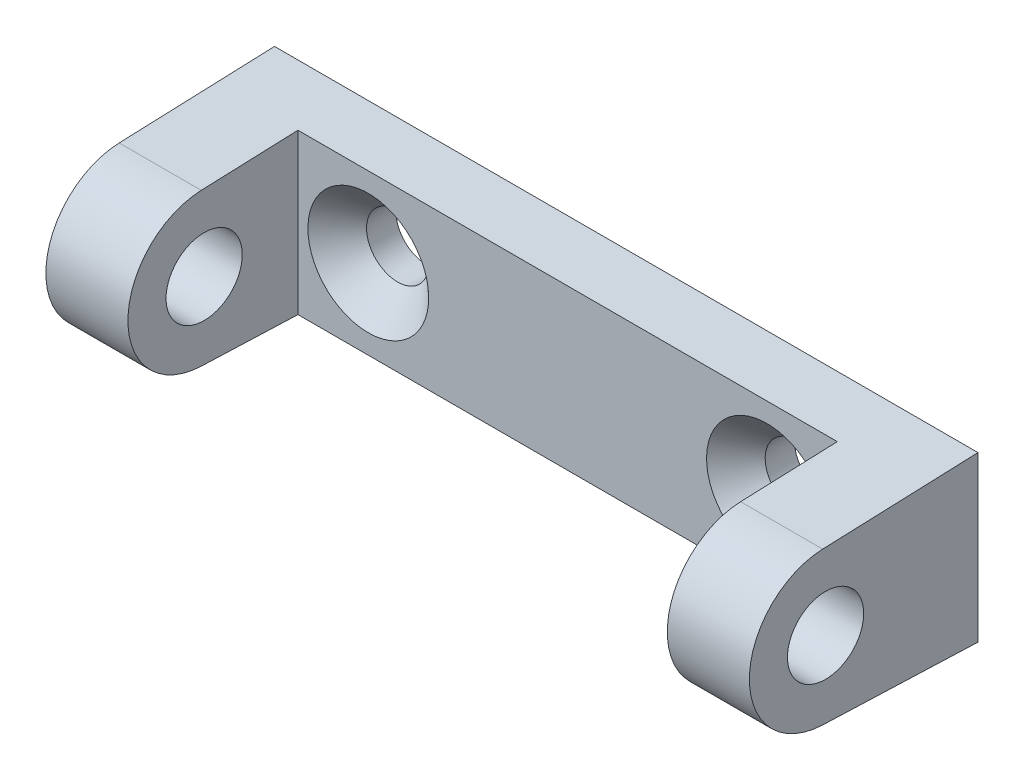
ISO-10303-21;
HEADER;
FILE_DESCRIPTION(('STEP AP214'),'2;1');
FILE_NAME('part.step','',(''),(''),'','','');
FILE_SCHEMA(('AUTOMOTIVE_DESIGN { 1 0 10303 214 1 1 1 1 }'));
ENDSEC;
DATA;
#1=APPLICATION_CONTEXT('core data for automotive mechanical design processes');
#2=APPLICATION_PROTOCOL_DEFINITION('international standard','automotive_design',2000,#1);
#3=PRODUCT_CONTEXT('',#1,'mechanical');
#4=PRODUCT('Part','Part','',(#3));
#5=PRODUCT_RELATED_PRODUCT_CATEGORY('part','',(#4));
#6=PRODUCT_DEFINITION_FORMATION('','',#4);
#7=PRODUCT_DEFINITION_CONTEXT('part definition',#1,'design');
#8=PRODUCT_DEFINITION('design','',#6,#7);
#9=PRODUCT_DEFINITION_SHAPE('','',#8);
#10=(LENGTH_UNIT() NAMED_UNIT(*) SI_UNIT(.MILLI.,.METRE.));
#11=(NAMED_UNIT(*) PLANE_ANGLE_UNIT() SI_UNIT($,.RADIAN.));
#12=(NAMED_UNIT(*) SI_UNIT($,.STERADIAN.) SOLID_ANGLE_UNIT());
#13=UNCERTAINTY_MEASURE_WITH_UNIT(LENGTH_MEASURE(1.E-05),#10,'distance_accuracy_value','');
#14=(GEOMETRIC_REPRESENTATION_CONTEXT(3) GLOBAL_UNCERTAINTY_ASSIGNED_CONTEXT((#13)) GLOBAL_UNIT_ASSIGNED_CONTEXT((#10,
#11,#12)) REPRESENTATION_CONTEXT('',''));
#15=CARTESIAN_POINT('',(0.,0.,0.));
#16=DIRECTION('',(0.,0.,1.));
#17=DIRECTION('',(1.,0.,0.));
#18=AXIS2_PLACEMENT_3D('',#15,#16,#17);
#19=CARTESIAN_POINT('',(-13.,0.,13.));
#20=DIRECTION('',(1.,0.,0.));
#21=DIRECTION('',(0.,1.,0.));
#22=AXIS2_PLACEMENT_3D('',#19,#20,#21);
#23=PLANE('',#22);
#24=CARTESIAN_POINT('',(-13.,0.,13.));
#25=DIRECTION('',(1.,0.,0.));
#26=DIRECTION('',(0.,1.,0.));
#27=AXIS2_PLACEMENT_3D('',#24,#25,#26);
#28=CIRCLE('',#27,6.5);
#29=CARTESIAN_POINT('',(-13.,6.49528769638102,13.2474626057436));
#30=VERTEX_POINT('',#29);
#31=CARTESIAN_POINT('',(-13.,-6.49528769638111,13.2474626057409));
#32=VERTEX_POINT('',#31);
#33=EDGE_CURVE('E142',#30,#32,#28,.T.);
#34=ORIENTED_EDGE('',*,*,#33,.F.);
#35=DIRECTION('',(0.,-0.0380711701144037,0.999275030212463));
#36=VECTOR('',#35,1.);
#37=CARTESIAN_POINT('',(-13.,6.49528769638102,13.2474626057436));
#38=LINE('',#37,#36);
#39=CARTESIAN_POINT('',(-13.,7.,0.));
#40=VERTEX_POINT('',#39);
#41=EDGE_CURVE('E149',#40,#30,#38,.T.);
#42=ORIENTED_EDGE('',*,*,#41,.F.);
#43=DIRECTION('',(0.,1.,0.));
#44=VECTOR('',#43,1.);
#45=CARTESIAN_POINT('',(-13.,7.,0.));
#46=LINE('',#45,#44);
#47=CARTESIAN_POINT('',(-13.,-7.,0.));
#48=VERTEX_POINT('',#47);
#49=EDGE_CURVE('E147',#48,#40,#46,.T.);
#50=ORIENTED_EDGE('',*,*,#49,.F.);
#51=DIRECTION('',(0.,-0.0380711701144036,-0.999275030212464));
#52=VECTOR('',#51,1.);
#53=CARTESIAN_POINT('',(-13.,-7.,0.));
#54=LINE('',#53,#52);
#55=EDGE_CURVE('E145',#32,#48,#54,.T.);
#56=ORIENTED_EDGE('',*,*,#55,.F.);
#57=EDGE_LOOP('',(#34,#42,#50,#56));
#58=FACE_BOUND('',#57,.T.);
#59=CARTESIAN_POINT('',(-13.,0.,13.));
#60=DIRECTION('',(1.,0.,0.));
#61=DIRECTION('',(0.,1.,0.));
#62=AXIS2_PLACEMENT_3D('',#59,#60,#61);
#63=CIRCLE('',#62,3.25);
#64=CARTESIAN_POINT('',(-13.,3.25000000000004,13.));
#65=VERTEX_POINT('',#64);
#66=EDGE_CURVE('E120',#65,#65,#63,.T.);
#67=ORIENTED_EDGE('',*,*,#66,.T.);
#68=EDGE_LOOP('',(#67));
#69=FACE_BOUND('',#68,.T.);
#70=ADVANCED_FACE('F14',(#58,#69),#23,.F.);
#71=CARTESIAN_POINT('',(47.,0.,13.));
#72=DIRECTION('',(1.,0.,0.));
#73=DIRECTION('',(0.,1.,0.));
#74=AXIS2_PLACEMENT_3D('',#71,#72,#73);
#75=PLANE('',#74);
#76=CARTESIAN_POINT('',(47.,0.,13.));
#77=DIRECTION('',(1.,0.,0.));
#78=DIRECTION('',(0.,1.,0.));
#79=AXIS2_PLACEMENT_3D('',#76,#77,#78);
#80=CIRCLE('',#79,6.5);
#81=CARTESIAN_POINT('',(47.,6.49528769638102,13.2474626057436));
#82=VERTEX_POINT('',#81);
#83=CARTESIAN_POINT('',(47.,-6.49528769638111,13.2474626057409));
#84=VERTEX_POINT('',#83);
#85=EDGE_CURVE('E152',#82,#84,#80,.T.);
#86=ORIENTED_EDGE('',*,*,#85,.T.);
#87=DIRECTION('',(0.,-0.0380711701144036,-0.999275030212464));
#88=VECTOR('',#87,1.);
#89=CARTESIAN_POINT('',(47.,-7.,0.));
#90=LINE('',#89,#88);
#91=CARTESIAN_POINT('',(47.,-7.,0.));
#92=VERTEX_POINT('',#91);
#93=EDGE_CURVE('E80',#84,#92,#90,.T.);
#94=ORIENTED_EDGE('',*,*,#93,.T.);
#95=DIRECTION('',(0.,1.,0.));
#96=VECTOR('',#95,1.);
#97=CARTESIAN_POINT('',(47.,7.,0.));
#98=LINE('',#97,#96);
#99=CARTESIAN_POINT('',(47.,7.,0.));
#100=VERTEX_POINT('',#99);
#101=EDGE_CURVE('E155',#92,#100,#98,.T.);
#102=ORIENTED_EDGE('',*,*,#101,.T.);
#103=DIRECTION('',(0.,-0.0380711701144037,0.999275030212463));
#104=VECTOR('',#103,1.);
#105=CARTESIAN_POINT('',(47.,6.49528769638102,13.2474626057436));
#106=LINE('',#105,#104);
#107=EDGE_CURVE('E157',#100,#82,#106,.T.);
#108=ORIENTED_EDGE('',*,*,#107,.T.);
#109=EDGE_LOOP('',(#86,#94,#102,#108));
#110=FACE_BOUND('',#109,.T.);
#111=CARTESIAN_POINT('',(47.,0.,13.));
#112=DIRECTION('',(1.,0.,0.));
#113=DIRECTION('',(0.,1.,0.));
#114=AXIS2_PLACEMENT_3D('',#111,#112,#113);
#115=CIRCLE('',#114,3.25);
#116=CARTESIAN_POINT('',(47.,3.25000000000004,13.));
#117=VERTEX_POINT('',#116);
#118=EDGE_CURVE('E117',#117,#117,#115,.T.);
#119=ORIENTED_EDGE('',*,*,#118,.F.);
#120=EDGE_LOOP('',(#119));
#121=FACE_BOUND('',#120,.T.);
#122=ADVANCED_FACE('F185',(#110,#121),#75,.T.);
#123=CARTESIAN_POINT('',(47.,7.,0.));
#124=DIRECTION('',(0.,0.,1.));
#125=DIRECTION('',(0.,-1.,0.));
#126=AXIS2_PLACEMENT_3D('',#123,#124,#125);
#127=PLANE('',#126);
#128=CARTESIAN_POINT('',(34.,0.,0.));
#129=DIRECTION('',(0.,0.,1.));
#130=DIRECTION('',(0.,-1.,0.));
#131=AXIS2_PLACEMENT_3D('',#128,#129,#130);
#132=CIRCLE('',#131,2.64999999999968);
#133=CARTESIAN_POINT('',(34.,-2.64999999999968,0.));
#134=VERTEX_POINT('',#133);
#135=EDGE_CURVE('E132',#134,#134,#132,.T.);
#136=ORIENTED_EDGE('',*,*,#135,.T.);
#137=EDGE_LOOP('',(#136));
#138=FACE_BOUND('',#137,.T.);
#139=ORIENTED_EDGE('',*,*,#49,.T.);
#140=DIRECTION('',(-1.,0.,0.));
#141=VECTOR('',#140,1.);
#142=CARTESIAN_POINT('',(47.,7.,0.));
#143=LINE('',#142,#141);
#144=EDGE_CURVE('E161',#100,#40,#143,.T.);
#145=ORIENTED_EDGE('',*,*,#144,.F.);
#146=ORIENTED_EDGE('',*,*,#101,.F.);
#147=DIRECTION('',(-1.,0.,0.));
#148=VECTOR('',#147,1.);
#149=CARTESIAN_POINT('',(47.,-7.,0.));
#150=LINE('',#149,#148);
#151=EDGE_CURVE('E164',#92,#48,#150,.T.);
#152=ORIENTED_EDGE('',*,*,#151,.T.);
#153=EDGE_LOOP('',(#139,#145,#146,#152));
#154=FACE_BOUND('',#153,.T.);
#155=CARTESIAN_POINT('',(0.,0.,0.));
#156=DIRECTION('',(0.,0.,1.));
#157=DIRECTION('',(0.,-1.,0.));
#158=AXIS2_PLACEMENT_3D('',#155,#156,#157);
#159=CIRCLE('',#158,2.64999999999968);
#160=CARTESIAN_POINT('',(0.,-2.64999999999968,0.));
#161=VERTEX_POINT('',#160);
#162=EDGE_CURVE('E123',#161,#161,#159,.T.);
#163=ORIENTED_EDGE('',*,*,#162,.T.);
#164=EDGE_LOOP('',(#163));
#165=FACE_BOUND('',#164,.T.);
#166=ADVANCED_FACE('F182',(#138,#154,#165),#127,.F.);
#167=CARTESIAN_POINT('',(-6.25,29.3487880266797,4.9999999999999));
#168=DIRECTION('',(0.,0.,1.));
#169=DIRECTION('',(1.,0.,0.));
#170=AXIS2_PLACEMENT_3D('',#167,#168,#169);
#171=PLANE('',#170);
#172=DIRECTION('',(0.,-1.,0.));
#173=VECTOR('',#172,1.);
#174=CARTESIAN_POINT('',(40.,6.8095060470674,5.));
#175=LINE('',#174,#173);
#176=CARTESIAN_POINT('',(40.,6.8095060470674,5.));
#177=VERTEX_POINT('',#176);
#178=CARTESIAN_POINT('',(40.,-6.8095060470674,5.));
#179=VERTEX_POINT('',#178);
#180=EDGE_CURVE('E33',#177,#179,#175,.T.);
#181=ORIENTED_EDGE('',*,*,#180,.F.);
#182=DIRECTION('',(-1.,0.,0.));
#183=VECTOR('',#182,1.);
#184=CARTESIAN_POINT('',(47.,6.8095060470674,5.));
#185=LINE('',#184,#183);
#186=CARTESIAN_POINT('',(-6.,6.8095060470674,5.));
#187=VERTEX_POINT('',#186);
#188=EDGE_CURVE('E9',#177,#187,#185,.T.);
#189=ORIENTED_EDGE('',*,*,#188,.T.);
#190=DIRECTION('',(0.,1.,0.));
#191=VECTOR('',#190,1.);
#192=CARTESIAN_POINT('',(-6.,-6.8095060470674,5.));
#193=LINE('',#192,#191);
#194=CARTESIAN_POINT('',(-6.,-6.8095060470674,5.));
#195=VERTEX_POINT('',#194);
#196=EDGE_CURVE('E111',#195,#187,#193,.T.);
#197=ORIENTED_EDGE('',*,*,#196,.F.);
#198=DIRECTION('',(1.,0.,0.));
#199=VECTOR('',#198,1.);
#200=CARTESIAN_POINT('',(47.,-6.8095060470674,5.));
#201=LINE('',#200,#199);
#202=EDGE_CURVE('E29',#195,#179,#201,.T.);
#203=ORIENTED_EDGE('',*,*,#202,.T.);
#204=EDGE_LOOP('',(#181,#189,#197,#203));
#205=FACE_BOUND('',#204,.T.);
#206=CARTESIAN_POINT('',(34.,0.,5.));
#207=DIRECTION('',(0.,0.,1.));
#208=DIRECTION('',(0.,-1.,0.));
#209=AXIS2_PLACEMENT_3D('',#206,#207,#208);
#210=CIRCLE('',#209,5.14999999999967);
#211=CARTESIAN_POINT('',(34.,-5.14999999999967,5.));
#212=VERTEX_POINT('',#211);
#213=EDGE_CURVE('E138',#212,#212,#210,.T.);
#214=ORIENTED_EDGE('',*,*,#213,.F.);
#215=EDGE_LOOP('',(#214));
#216=FACE_BOUND('',#215,.T.);
#217=CARTESIAN_POINT('',(0.,0.,5.));
#218=DIRECTION('',(0.,0.,1.));
#219=DIRECTION('',(0.,-1.,0.));
#220=AXIS2_PLACEMENT_3D('',#217,#218,#219);
#221=CIRCLE('',#220,5.14999999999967);
#222=CARTESIAN_POINT('',(0.,-5.14999999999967,5.));
#223=VERTEX_POINT('',#222);
#224=EDGE_CURVE('E129',#223,#223,#221,.T.);
#225=ORIENTED_EDGE('',*,*,#224,.F.);
#226=EDGE_LOOP('',(#225));
#227=FACE_BOUND('',#226,.T.);
#228=ADVANCED_FACE('F187',(#205,#216,#227),#171,.T.);
#229=CARTESIAN_POINT('',(47.,0.,13.));
#230=DIRECTION('',(-1.,0.,0.));
#231=DIRECTION('',(0.,-1.,0.));
#232=AXIS2_PLACEMENT_3D('',#229,#230,#231);
#233=CYLINDRICAL_SURFACE('',#232,6.5);
#234=DIRECTION('',(-1.,0.,0.));
#235=VECTOR('',#234,1.);
#236=CARTESIAN_POINT('',(47.,-6.49528769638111,13.2474626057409));
#237=LINE('',#236,#235);
#238=CARTESIAN_POINT('',(-6.,-6.49528769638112,13.2474626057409));
#239=VERTEX_POINT('',#238);
#240=EDGE_CURVE('E85',#239,#32,#237,.T.);
#241=ORIENTED_EDGE('',*,*,#240,.F.);
#242=CARTESIAN_POINT('',(-6.,0.,13.));
#243=DIRECTION('',(1.,0.,0.));
#244=DIRECTION('',(0.,0.,-1.));
#245=AXIS2_PLACEMENT_3D('',#242,#243,#244);
#246=CIRCLE('',#245,6.5);
#247=CARTESIAN_POINT('',(-6.,6.49528769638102,13.2474626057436));
#248=VERTEX_POINT('',#247);
#249=EDGE_CURVE('E105',#248,#239,#246,.T.);
#250=ORIENTED_EDGE('',*,*,#249,.F.);
#251=DIRECTION('',(-1.,0.,0.));
#252=VECTOR('',#251,1.);
#253=CARTESIAN_POINT('',(47.,6.49528769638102,13.2474626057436));
#254=LINE('',#253,#252);
#255=EDGE_CURVE('E159',#248,#30,#254,.T.);
#256=ORIENTED_EDGE('',*,*,#255,.T.);
#257=ORIENTED_EDGE('',*,*,#33,.T.);
#258=EDGE_LOOP('',(#241,#250,#256,#257));
#259=FACE_BOUND('',#258,.T.);
#260=ADVANCED_FACE('F16',(#259),#233,.T.);
#261=CARTESIAN_POINT('',(40.,6.49528769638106,13.2474626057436));
#262=VERTEX_POINT('',#261);
#263=EDGE_CURVE('E96',#82,#262,#254,.T.);
#264=ORIENTED_EDGE('',*,*,#263,.T.);
#265=CARTESIAN_POINT('',(40.,0.,13.));
#266=DIRECTION('',(-1.,0.,0.));
#267=DIRECTION('',(0.,0.,1.));
#268=AXIS2_PLACEMENT_3D('',#265,#266,#267);
#269=CIRCLE('',#268,6.5);
#270=CARTESIAN_POINT('',(40.,-6.49528769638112,13.2474626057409));
#271=VERTEX_POINT('',#270);
#272=EDGE_CURVE('E91',#271,#262,#269,.T.);
#273=ORIENTED_EDGE('',*,*,#272,.F.);
#274=EDGE_CURVE('E22',#84,#271,#237,.T.);
#275=ORIENTED_EDGE('',*,*,#274,.F.);
#276=ORIENTED_EDGE('',*,*,#85,.F.);
#277=EDGE_LOOP('',(#264,#273,#275,#276));
#278=FACE_BOUND('',#277,.T.);
#279=ADVANCED_FACE('F94',(#278),#233,.T.);
#280=CARTESIAN_POINT('',(47.,-7.,0.));
#281=DIRECTION('',(0.,0.999275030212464,-0.0380711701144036));
#282=DIRECTION('',(0.,0.0380711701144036,0.999275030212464));
#283=AXIS2_PLACEMENT_3D('',#280,#281,#282);
#284=PLANE('',#283);
#285=ORIENTED_EDGE('',*,*,#202,.F.);
#286=DIRECTION('',(0.,-0.0380711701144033,-0.999275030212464));
#287=VECTOR('',#286,1.);
#288=CARTESIAN_POINT('',(-6.,-6.49528769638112,13.2474626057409));
#289=LINE('',#288,#287);
#290=EDGE_CURVE('E108',#239,#195,#289,.T.);
#291=ORIENTED_EDGE('',*,*,#290,.F.);
#292=ORIENTED_EDGE('',*,*,#240,.T.);
#293=ORIENTED_EDGE('',*,*,#55,.T.);
#294=ORIENTED_EDGE('',*,*,#151,.F.);
#295=ORIENTED_EDGE('',*,*,#93,.F.);
#296=ORIENTED_EDGE('',*,*,#274,.T.);
#297=DIRECTION('',(0.,0.0380711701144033,0.999275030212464));
#298=VECTOR('',#297,1.);
#299=CARTESIAN_POINT('',(40.,-6.8095060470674,5.));
#300=LINE('',#299,#298);
#301=EDGE_CURVE('E78',#179,#271,#300,.T.);
#302=ORIENTED_EDGE('',*,*,#301,.F.);
#303=EDGE_LOOP('',(#285,#291,#292,#293,#294,#295,#296,#302));
#304=FACE_BOUND('',#303,.T.);
#305=ADVANCED_FACE('F77',(#304),#284,.F.);
#306=CARTESIAN_POINT('',(47.,6.49528769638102,13.2474626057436));
#307=DIRECTION('',(0.,-0.999275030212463,-0.0380711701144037));
#308=DIRECTION('',(0.,0.0380711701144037,-0.999275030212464));
#309=AXIS2_PLACEMENT_3D('',#306,#307,#308);
#310=PLANE('',#309);
#311=ORIENTED_EDGE('',*,*,#188,.F.);
#312=DIRECTION('',(0.,0.0380711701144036,-0.999275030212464));
#313=VECTOR('',#312,1.);
#314=CARTESIAN_POINT('',(40.,6.49528769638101,13.2474626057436));
#315=LINE('',#314,#313);
#316=EDGE_CURVE('E97',#262,#177,#315,.T.);
#317=ORIENTED_EDGE('',*,*,#316,.F.);
#318=ORIENTED_EDGE('',*,*,#263,.F.);
#319=ORIENTED_EDGE('',*,*,#107,.F.);
#320=ORIENTED_EDGE('',*,*,#144,.T.);
#321=ORIENTED_EDGE('',*,*,#41,.T.);
#322=ORIENTED_EDGE('',*,*,#255,.F.);
#323=DIRECTION('',(0.,-0.038071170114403,0.999275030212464));
#324=VECTOR('',#323,1.);
#325=CARTESIAN_POINT('',(-6.,6.8095060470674,5.));
#326=LINE('',#325,#324);
#327=EDGE_CURVE('E114',#187,#248,#326,.T.);
#328=ORIENTED_EDGE('',*,*,#327,.F.);
#329=EDGE_LOOP('',(#311,#317,#318,#319,#320,#321,#322,#328));
#330=FACE_BOUND('',#329,.T.);
#331=ADVANCED_FACE('F179',(#330),#310,.F.);
#332=CARTESIAN_POINT('',(34.,0.,2.5));
#333=DIRECTION('',(0.,0.,1.));
#334=DIRECTION('',(0.,-1.,0.));
#335=AXIS2_PLACEMENT_3D('',#332,#333,#334);
#336=CONICAL_SURFACE('',#335,2.64999999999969,0.785398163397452);
#337=ORIENTED_EDGE('',*,*,#213,.T.);
#338=EDGE_LOOP('',(#337));
#339=FACE_BOUND('',#338,.T.);
#340=CARTESIAN_POINT('',(34.,0.,2.5));
#341=DIRECTION('',(0.,0.,1.));
#342=DIRECTION('',(0.,-1.,0.));
#343=AXIS2_PLACEMENT_3D('',#340,#341,#342);
#344=CIRCLE('',#343,2.64999999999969);
#345=CARTESIAN_POINT('',(34.,-2.64999999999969,2.5));
#346=VERTEX_POINT('',#345);
#347=EDGE_CURVE('E135',#346,#346,#344,.T.);
#348=ORIENTED_EDGE('',*,*,#347,.F.);
#349=EDGE_LOOP('',(#348));
#350=FACE_BOUND('',#349,.T.);
#351=ADVANCED_FACE('F220',(#339,#350),#336,.F.);
#352=CARTESIAN_POINT('',(34.,0.,6.0000000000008));
#353=DIRECTION('',(0.,0.,1.));
#354=DIRECTION('',(0.,-1.,0.));
#355=AXIS2_PLACEMENT_3D('',#352,#353,#354);
#356=CYLINDRICAL_SURFACE('',#355,2.64999999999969);
#357=ORIENTED_EDGE('',*,*,#347,.T.);
#358=EDGE_LOOP('',(#357));
#359=FACE_BOUND('',#358,.T.);
#360=ORIENTED_EDGE('',*,*,#135,.F.);
#361=EDGE_LOOP('',(#360));
#362=FACE_BOUND('',#361,.T.);
#363=ADVANCED_FACE('F292',(#359,#362),#356,.F.);
#364=CARTESIAN_POINT('',(0.,0.,2.5));
#365=DIRECTION('',(0.,0.,1.));
#366=DIRECTION('',(0.,-1.,0.));
#367=AXIS2_PLACEMENT_3D('',#364,#365,#366);
#368=CONICAL_SURFACE('',#367,2.64999999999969,0.785398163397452);
#369=ORIENTED_EDGE('',*,*,#224,.T.);
#370=EDGE_LOOP('',(#369));
#371=FACE_BOUND('',#370,.T.);
#372=CARTESIAN_POINT('',(0.,0.,2.5));
#373=DIRECTION('',(0.,0.,1.));
#374=DIRECTION('',(0.,-1.,0.));
#375=AXIS2_PLACEMENT_3D('',#372,#373,#374);
#376=CIRCLE('',#375,2.64999999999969);
#377=CARTESIAN_POINT('',(0.,-2.64999999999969,2.5));
#378=VERTEX_POINT('',#377);
#379=EDGE_CURVE('E126',#378,#378,#376,.T.);
#380=ORIENTED_EDGE('',*,*,#379,.F.);
#381=EDGE_LOOP('',(#380));
#382=FACE_BOUND('',#381,.T.);
#383=ADVANCED_FACE('F301',(#371,#382),#368,.F.);
#384=CARTESIAN_POINT('',(0.,0.,6.0000000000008));
#385=DIRECTION('',(0.,0.,1.));
#386=DIRECTION('',(0.,-1.,0.));
#387=AXIS2_PLACEMENT_3D('',#384,#385,#386);
#388=CYLINDRICAL_SURFACE('',#387,2.64999999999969);
#389=ORIENTED_EDGE('',*,*,#379,.T.);
#390=EDGE_LOOP('',(#389));
#391=FACE_BOUND('',#390,.T.);
#392=ORIENTED_EDGE('',*,*,#162,.F.);
#393=EDGE_LOOP('',(#392));
#394=FACE_BOUND('',#393,.T.);
#395=ADVANCED_FACE('F205',(#391,#394),#388,.F.);
#396=CARTESIAN_POINT('',(-17.75,0.,13.));
#397=DIRECTION('',(1.,0.,0.));
#398=DIRECTION('',(0.,1.,0.));
#399=AXIS2_PLACEMENT_3D('',#396,#397,#398);
#400=CYLINDRICAL_SURFACE('',#399,3.25);
#401=ORIENTED_EDGE('',*,*,#118,.T.);
#402=EDGE_LOOP('',(#401));
#403=FACE_BOUND('',#402,.T.);
#404=CARTESIAN_POINT('',(40.,0.,13.));
#405=DIRECTION('',(-1.,0.,0.));
#406=DIRECTION('',(0.,0.,1.));
#407=AXIS2_PLACEMENT_3D('',#404,#405,#406);
#408=CIRCLE('',#407,3.25);
#409=CARTESIAN_POINT('',(40.,0.,16.25));
#410=VERTEX_POINT('',#409);
#411=EDGE_CURVE('E355',#410,#410,#408,.T.);
#412=ORIENTED_EDGE('',*,*,#411,.T.);
#413=EDGE_LOOP('',(#412));
#414=FACE_BOUND('',#413,.T.);
#415=ADVANCED_FACE('F198',(#403,#414),#400,.F.);
#416=ORIENTED_EDGE('',*,*,#66,.F.);
#417=EDGE_LOOP('',(#416));
#418=FACE_BOUND('',#417,.T.);
#419=CARTESIAN_POINT('',(-6.,0.,13.));
#420=DIRECTION('',(1.,0.,0.));
#421=DIRECTION('',(0.,0.,-1.));
#422=AXIS2_PLACEMENT_3D('',#419,#420,#421);
#423=CIRCLE('',#422,3.25);
#424=CARTESIAN_POINT('',(-6.,0.,9.75));
#425=VERTEX_POINT('',#424);
#426=EDGE_CURVE('E99',#425,#425,#423,.T.);
#427=ORIENTED_EDGE('',*,*,#426,.T.);
#428=EDGE_LOOP('',(#427));
#429=FACE_BOUND('',#428,.T.);
#430=ADVANCED_FACE('F193',(#418,#429),#400,.F.);
#431=CARTESIAN_POINT('',(-6.,0.,13.));
#432=DIRECTION('',(1.,0.,0.));
#433=DIRECTION('',(0.,0.,-1.));
#434=AXIS2_PLACEMENT_3D('',#431,#432,#433);
#435=PLANE('',#434);
#436=ORIENTED_EDGE('',*,*,#249,.T.);
#437=ORIENTED_EDGE('',*,*,#290,.T.);
#438=ORIENTED_EDGE('',*,*,#196,.T.);
#439=ORIENTED_EDGE('',*,*,#327,.T.);
#440=EDGE_LOOP('',(#436,#437,#438,#439));
#441=FACE_BOUND('',#440,.T.);
#442=ORIENTED_EDGE('',*,*,#426,.F.);
#443=EDGE_LOOP('',(#442));
#444=FACE_BOUND('',#443,.T.);
#445=ADVANCED_FACE('F190',(#441,#444),#435,.T.);
#446=CARTESIAN_POINT('',(40.,0.,13.));
#447=DIRECTION('',(-1.,0.,0.));
#448=DIRECTION('',(0.,0.,1.));
#449=AXIS2_PLACEMENT_3D('',#446,#447,#448);
#450=PLANE('',#449);
#451=ORIENTED_EDGE('',*,*,#180,.T.);
#452=ORIENTED_EDGE('',*,*,#301,.T.);
#453=ORIENTED_EDGE('',*,*,#272,.T.);
#454=ORIENTED_EDGE('',*,*,#316,.T.);
#455=EDGE_LOOP('',(#451,#452,#453,#454));
#456=FACE_BOUND('',#455,.T.);
#457=ORIENTED_EDGE('',*,*,#411,.F.);
#458=EDGE_LOOP('',(#457));
#459=FACE_BOUND('',#458,.T.);
#460=ADVANCED_FACE('F88',(#456,#459),#450,.T.);
#461=CLOSED_SHELL('',(#70,#122,#166,#228,#260,#279,#305,#331,#351,#363,#383,#395,#415,#430,#445,#460));
#462=MANIFOLD_SOLID_BREP('B1',#461);
#463=ADVANCED_BREP_SHAPE_REPRESENTATION('',(#18,#462),#14);
#464=SHAPE_DEFINITION_REPRESENTATION(#9,#463);
ENDSEC;
END-ISO-10303-21;
